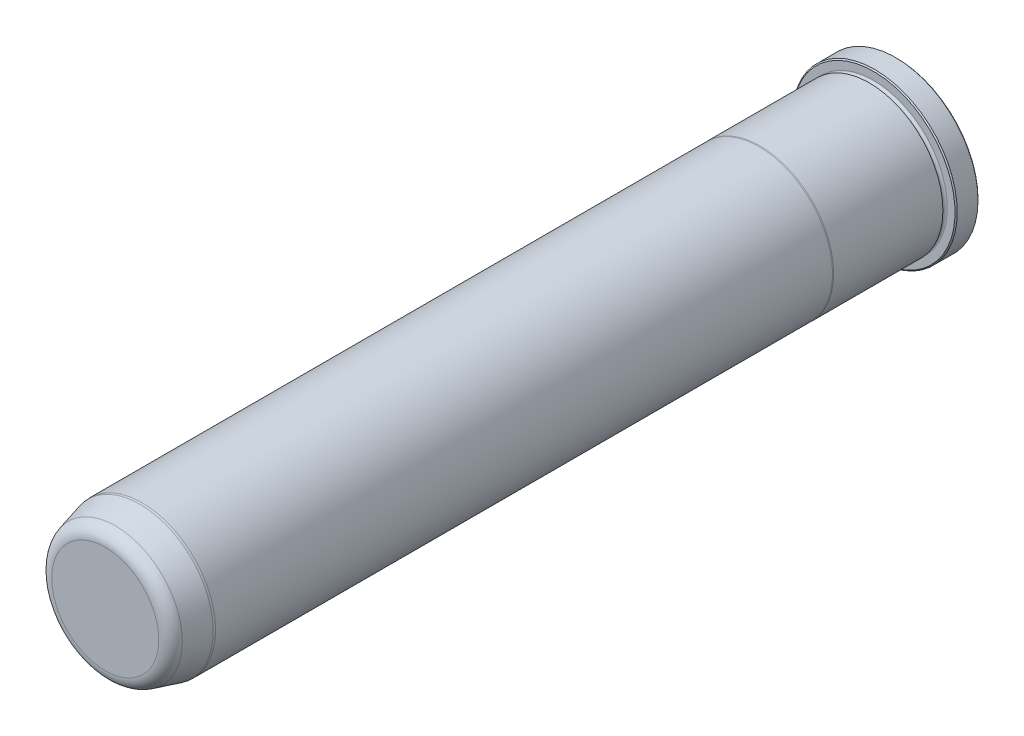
ISO-10303-21;
HEADER;
FILE_DESCRIPTION(('STEP AP214'),'2;1');
FILE_NAME('part.step','',(''),(''),'','','');
FILE_SCHEMA(('AUTOMOTIVE_DESIGN { 1 0 10303 214 1 1 1 1 }'));
ENDSEC;
DATA;
#1=APPLICATION_CONTEXT('core data for automotive mechanical design processes');
#2=APPLICATION_PROTOCOL_DEFINITION('international standard','automotive_design',2000,#1);
#3=PRODUCT_CONTEXT('',#1,'mechanical');
#4=PRODUCT('Part','Part','',(#3));
#5=PRODUCT_RELATED_PRODUCT_CATEGORY('part','',(#4));
#6=PRODUCT_DEFINITION_FORMATION('','',#4);
#7=PRODUCT_DEFINITION_CONTEXT('part definition',#1,'design');
#8=PRODUCT_DEFINITION('design','',#6,#7);
#9=PRODUCT_DEFINITION_SHAPE('','',#8);
#10=(LENGTH_UNIT() NAMED_UNIT(*) SI_UNIT(.MILLI.,.METRE.));
#11=(NAMED_UNIT(*) PLANE_ANGLE_UNIT() SI_UNIT($,.RADIAN.));
#12=(NAMED_UNIT(*) SI_UNIT($,.STERADIAN.) SOLID_ANGLE_UNIT());
#13=UNCERTAINTY_MEASURE_WITH_UNIT(LENGTH_MEASURE(1.E-05),#10,'distance_accuracy_value','');
#14=(GEOMETRIC_REPRESENTATION_CONTEXT(3) GLOBAL_UNCERTAINTY_ASSIGNED_CONTEXT((#13)) GLOBAL_UNIT_ASSIGNED_CONTEXT((#10,
#11,#12)) REPRESENTATION_CONTEXT('',''));
#15=CARTESIAN_POINT('',(0.,0.,0.));
#16=DIRECTION('',(0.,0.,1.));
#17=DIRECTION('',(1.,0.,0.));
#18=AXIS2_PLACEMENT_3D('',#15,#16,#17);
#19=CARTESIAN_POINT('',(0.,0.,0.));
#20=DIRECTION('',(0.,0.,1.));
#21=DIRECTION('',(1.,0.,0.));
#22=AXIS2_PLACEMENT_3D('',#19,#20,#21);
#23=PLANE('',#22);
#24=CARTESIAN_POINT('',(0.,0.,0.));
#25=DIRECTION('',(0.,0.,1.));
#26=DIRECTION('',(1.,0.,0.));
#27=AXIS2_PLACEMENT_3D('',#24,#25,#26);
#28=CIRCLE('',#27,28.067);
#29=CARTESIAN_POINT('',(28.067,0.,0.));
#30=VERTEX_POINT('',#29);
#31=EDGE_CURVE('E37',#30,#30,#28,.F.);
#32=ORIENTED_EDGE('',*,*,#31,.T.);
#33=EDGE_LOOP('',(#32));
#34=FACE_BOUND('',#33,.T.);
#35=ADVANCED_FACE('F30',(#34),#23,.F.);
#36=CARTESIAN_POINT('',(0.,0.,0.));
#37=DIRECTION('',(0.,0.,1.));
#38=DIRECTION('',(1.,0.,0.));
#39=AXIS2_PLACEMENT_3D('',#36,#37,#38);
#40=CYLINDRICAL_SURFACE('',#39,28.448);
#41=CARTESIAN_POINT('',(0.,0.,0.380999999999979));
#42=DIRECTION('',(0.,0.,1.));
#43=DIRECTION('',(1.,0.,0.));
#44=AXIS2_PLACEMENT_3D('',#41,#42,#43);
#45=CIRCLE('',#44,28.448);
#46=CARTESIAN_POINT('',(28.448,0.,0.380999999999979));
#47=VERTEX_POINT('',#46);
#48=EDGE_CURVE('E41',#47,#47,#45,.T.);
#49=ORIENTED_EDGE('',*,*,#48,.T.);
#50=EDGE_LOOP('',(#49));
#51=FACE_BOUND('',#50,.T.);
#52=CARTESIAN_POINT('',(0.,0.,7.54379999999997));
#53=DIRECTION('',(0.,0.,-1.));
#54=DIRECTION('',(-1.,0.,0.));
#55=AXIS2_PLACEMENT_3D('',#52,#53,#54);
#56=CIRCLE('',#55,28.448);
#57=CARTESIAN_POINT('',(-28.448,0.,7.54379999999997));
#58=VERTEX_POINT('',#57);
#59=EDGE_CURVE('E45',#58,#58,#56,.T.);
#60=ORIENTED_EDGE('',*,*,#59,.T.);
#61=EDGE_LOOP('',(#60));
#62=FACE_BOUND('',#61,.T.);
#63=ADVANCED_FACE('F118',(#51,#62),#40,.T.);
#64=CARTESIAN_POINT('',(0.,28.448,7.9248));
#65=DIRECTION('',(0.,0.,-1.));
#66=DIRECTION('',(-1.,0.,0.));
#67=AXIS2_PLACEMENT_3D('',#64,#65,#66);
#68=PLANE('',#67);
#69=CARTESIAN_POINT('',(0.,0.,7.9248));
#70=DIRECTION('',(0.,0.,-1.));
#71=DIRECTION('',(-1.,0.,0.));
#72=AXIS2_PLACEMENT_3D('',#69,#70,#71);
#73=CIRCLE('',#72,28.067);
#74=CARTESIAN_POINT('',(-28.067,0.,7.9248));
#75=VERTEX_POINT('',#74);
#76=EDGE_CURVE('E10',#75,#75,#73,.F.);
#77=ORIENTED_EDGE('',*,*,#76,.T.);
#78=EDGE_LOOP('',(#77));
#79=FACE_BOUND('',#78,.T.);
#80=CARTESIAN_POINT('',(0.,0.,7.9248));
#81=DIRECTION('',(0.,0.,1.));
#82=DIRECTION('',(1.,0.,0.));
#83=AXIS2_PLACEMENT_3D('',#80,#81,#82);
#84=CIRCLE('',#83,25.3873);
#85=CARTESIAN_POINT('',(25.3873,0.,7.9248));
#86=VERTEX_POINT('',#85);
#87=EDGE_CURVE('E56',#86,#86,#84,.T.);
#88=ORIENTED_EDGE('',*,*,#87,.F.);
#89=EDGE_LOOP('',(#88));
#90=FACE_BOUND('',#89,.T.);
#91=ADVANCED_FACE('F113',(#79,#90),#68,.F.);
#92=CARTESIAN_POINT('',(0.,0.,8.6868));
#93=DIRECTION('',(0.,0.,1.));
#94=DIRECTION('',(1.,0.,0.));
#95=AXIS2_PLACEMENT_3D('',#92,#93,#94);
#96=TOROIDAL_SURFACE('',#95,25.3873,0.761999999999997);
#97=CARTESIAN_POINT('',(0.,0.,9.44879999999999));
#98=DIRECTION('',(0.,0.,1.));
#99=DIRECTION('',(1.,0.,0.));
#100=AXIS2_PLACEMENT_3D('',#97,#98,#99);
#101=CIRCLE('',#100,25.3873);
#102=CARTESIAN_POINT('',(25.3873,0.,9.44879999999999));
#103=VERTEX_POINT('',#102);
#104=EDGE_CURVE('E59',#103,#103,#101,.T.);
#105=ORIENTED_EDGE('',*,*,#104,.F.);
#106=EDGE_LOOP('',(#105));
#107=FACE_BOUND('',#106,.T.);
#108=ORIENTED_EDGE('',*,*,#87,.T.);
#109=EDGE_LOOP('',(#108));
#110=FACE_BOUND('',#109,.T.);
#111=ADVANCED_FACE('F107',(#107,#110),#96,.F.);
#112=CARTESIAN_POINT('',(0.,25.3873,9.44879999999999));
#113=DIRECTION('',(0.,0.,1.));
#114=DIRECTION('',(1.,0.,0.));
#115=AXIS2_PLACEMENT_3D('',#112,#113,#114);
#116=PLANE('',#115);
#117=CARTESIAN_POINT('',(0.,0.,9.4488));
#118=DIRECTION('',(0.,0.,1.));
#119=DIRECTION('',(1.,0.,0.));
#120=AXIS2_PLACEMENT_3D('',#117,#118,#119);
#121=CIRCLE('',#120,25.4127);
#122=CARTESIAN_POINT('',(25.4127,0.,9.4488));
#123=VERTEX_POINT('',#122);
#124=EDGE_CURVE('E62',#123,#123,#121,.T.);
#125=ORIENTED_EDGE('',*,*,#124,.F.);
#126=EDGE_LOOP('',(#125));
#127=FACE_BOUND('',#126,.T.);
#128=ORIENTED_EDGE('',*,*,#104,.T.);
#129=EDGE_LOOP('',(#128));
#130=FACE_BOUND('',#129,.T.);
#131=ADVANCED_FACE('F101',(#127,#130),#116,.F.);
#132=CARTESIAN_POINT('',(0.,0.,0.));
#133=DIRECTION('',(0.,0.,1.));
#134=DIRECTION('',(1.,0.,0.));
#135=AXIS2_PLACEMENT_3D('',#132,#133,#134);
#136=CYLINDRICAL_SURFACE('',#135,25.4127);
#137=CARTESIAN_POINT('',(0.,0.,47.1347630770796));
#138=DIRECTION('',(0.,0.,1.));
#139=DIRECTION('',(1.,0.,0.));
#140=AXIS2_PLACEMENT_3D('',#137,#138,#139);
#141=CIRCLE('',#140,25.4127);
#142=CARTESIAN_POINT('',(25.4127,0.,47.1347630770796));
#143=VERTEX_POINT('',#142);
#144=EDGE_CURVE('E65',#143,#143,#141,.T.);
#145=ORIENTED_EDGE('',*,*,#144,.F.);
#146=EDGE_LOOP('',(#145));
#147=FACE_BOUND('',#146,.T.);
#148=ORIENTED_EDGE('',*,*,#124,.T.);
#149=EDGE_LOOP('',(#148));
#150=FACE_BOUND('',#149,.T.);
#151=ADVANCED_FACE('F95',(#147,#150),#136,.T.);
#152=CARTESIAN_POINT('',(0.,0.,47.1347630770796));
#153=DIRECTION('',(0.,0.,-1.));
#154=DIRECTION('',(-1.,0.,0.));
#155=AXIS2_PLACEMENT_3D('',#152,#153,#154);
#156=CONICAL_SURFACE('',#155,25.4127,0.0698131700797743);
#157=CARTESIAN_POINT('',(0.,0.,47.498));
#158=DIRECTION('',(0.,0.,1.));
#159=DIRECTION('',(1.,0.,0.));
#160=AXIS2_PLACEMENT_3D('',#157,#158,#159);
#161=CIRCLE('',#160,25.3873);
#162=CARTESIAN_POINT('',(25.3873,0.,47.498));
#163=VERTEX_POINT('',#162);
#164=EDGE_CURVE('E68',#163,#163,#161,.T.);
#165=ORIENTED_EDGE('',*,*,#164,.F.);
#166=EDGE_LOOP('',(#165));
#167=FACE_BOUND('',#166,.T.);
#168=ORIENTED_EDGE('',*,*,#144,.T.);
#169=EDGE_LOOP('',(#168));
#170=FACE_BOUND('',#169,.T.);
#171=ADVANCED_FACE('F89',(#167,#170),#156,.T.);
#172=CARTESIAN_POINT('',(0.,0.,0.));
#173=DIRECTION('',(0.,0.,1.));
#174=DIRECTION('',(1.,0.,0.));
#175=AXIS2_PLACEMENT_3D('',#172,#173,#174);
#176=CYLINDRICAL_SURFACE('',#175,25.3873);
#177=CARTESIAN_POINT('',(0.,0.,260.35));
#178=DIRECTION('',(0.,0.,1.));
#179=DIRECTION('',(1.,0.,0.));
#180=AXIS2_PLACEMENT_3D('',#177,#178,#179);
#181=CIRCLE('',#180,25.3873);
#182=CARTESIAN_POINT('',(25.3873,0.,260.35));
#183=VERTEX_POINT('',#182);
#184=EDGE_CURVE('E71',#183,#183,#181,.T.);
#185=ORIENTED_EDGE('',*,*,#184,.F.);
#186=EDGE_LOOP('',(#185));
#187=FACE_BOUND('',#186,.T.);
#188=ORIENTED_EDGE('',*,*,#164,.T.);
#189=EDGE_LOOP('',(#188));
#190=FACE_BOUND('',#189,.T.);
#191=ADVANCED_FACE('F83',(#187,#190),#176,.T.);
#192=CARTESIAN_POINT('',(0.,0.,260.35));
#193=DIRECTION('',(0.,0.,-1.));
#194=DIRECTION('',(-1.,0.,0.));
#195=AXIS2_PLACEMENT_3D('',#192,#193,#194);
#196=CONICAL_SURFACE('',#195,25.3873,0.0872664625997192);
#197=CARTESIAN_POINT('',(0.,0.,261.112));
#198=DIRECTION('',(0.,0.,1.));
#199=DIRECTION('',(1.,0.,0.));
#200=AXIS2_PLACEMENT_3D('',#197,#198,#199);
#201=CIRCLE('',#200,25.3206336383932);
#202=CARTESIAN_POINT('',(25.3206336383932,0.,261.112));
#203=VERTEX_POINT('',#202);
#204=EDGE_CURVE('E74',#203,#203,#201,.T.);
#205=ORIENTED_EDGE('',*,*,#204,.F.);
#206=EDGE_LOOP('',(#205));
#207=FACE_BOUND('',#206,.T.);
#208=ORIENTED_EDGE('',*,*,#184,.T.);
#209=EDGE_LOOP('',(#208));
#210=FACE_BOUND('',#209,.T.);
#211=ADVANCED_FACE('F80',(#207,#210),#196,.T.);
#212=CARTESIAN_POINT('',(0.,0.,261.112));
#213=DIRECTION('',(0.,0.,-1.));
#214=DIRECTION('',(-1.,0.,0.));
#215=AXIS2_PLACEMENT_3D('',#212,#213,#214);
#216=CONICAL_SURFACE('',#215,25.3206336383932,0.261799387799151);
#217=CARTESIAN_POINT('',(0.,0.,269.520125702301));
#218=DIRECTION('',(0.,0.,1.));
#219=DIRECTION('',(1.,0.,0.));
#220=AXIS2_PLACEMENT_3D('',#217,#218,#219);
#221=CIRCLE('',#220,23.0676831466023);
#222=CARTESIAN_POINT('',(23.0676831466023,0.,269.520125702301));
#223=VERTEX_POINT('',#222);
#224=EDGE_CURVE('E50',#223,#223,#221,.F.);
#225=ORIENTED_EDGE('',*,*,#224,.T.);
#226=EDGE_LOOP('',(#225));
#227=FACE_BOUND('',#226,.T.);
#228=ORIENTED_EDGE('',*,*,#204,.T.);
#229=EDGE_LOOP('',(#228));
#230=FACE_BOUND('',#229,.T.);
#231=ADVANCED_FACE('F78',(#227,#230),#216,.T.);
#232=CARTESIAN_POINT('',(0.,22.1218561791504,273.05));
#233=DIRECTION('',(0.,0.,-1.));
#234=DIRECTION('',(-1.,0.,0.));
#235=AXIS2_PLACEMENT_3D('',#232,#233,#234);
#236=PLANE('',#235);
#237=CARTESIAN_POINT('',(0.,0.,273.05));
#238=DIRECTION('',(0.,0.,-1.));
#239=DIRECTION('',(-1.,0.,0.));
#240=AXIS2_PLACEMENT_3D('',#237,#238,#239);
#241=CIRCLE('',#240,18.4674613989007);
#242=CARTESIAN_POINT('',(-18.4674613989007,0.,273.05));
#243=VERTEX_POINT('',#242);
#244=EDGE_CURVE('E53',#243,#243,#241,.F.);
#245=ORIENTED_EDGE('',*,*,#244,.T.);
#246=EDGE_LOOP('',(#245));
#247=FACE_BOUND('',#246,.T.);
#248=ADVANCED_FACE('F133',(#247),#236,.F.);
#249=CARTESIAN_POINT('',(0.,0.,268.2875));
#250=DIRECTION('',(0.,0.,-1.));
#251=DIRECTION('',(-1.,0.,0.));
#252=AXIS2_PLACEMENT_3D('',#249,#250,#251);
#253=TOROIDAL_SURFACE('',#252,18.4674613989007,4.7625);
#254=ORIENTED_EDGE('',*,*,#224,.F.);
#255=EDGE_LOOP('',(#254));
#256=FACE_BOUND('',#255,.T.);
#257=ORIENTED_EDGE('',*,*,#244,.F.);
#258=EDGE_LOOP('',(#257));
#259=FACE_BOUND('',#258,.T.);
#260=ADVANCED_FACE('F130',(#256,#259),#253,.T.);
#261=CARTESIAN_POINT('',(0.,0.,0.380999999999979));
#262=DIRECTION('',(0.,0.,1.));
#263=DIRECTION('',(1.,0.,0.));
#264=AXIS2_PLACEMENT_3D('',#261,#262,#263);
#265=CONICAL_SURFACE('',#264,28.448,0.785398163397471);
#266=ORIENTED_EDGE('',*,*,#31,.F.);
#267=EDGE_LOOP('',(#266));
#268=FACE_BOUND('',#267,.T.);
#269=ORIENTED_EDGE('',*,*,#48,.F.);
#270=EDGE_LOOP('',(#269));
#271=FACE_BOUND('',#270,.T.);
#272=ADVANCED_FACE('F132',(#268,#271),#265,.T.);
#273=CARTESIAN_POINT('',(0.,0.,7.9248));
#274=DIRECTION('',(0.,0.,-1.));
#275=DIRECTION('',(-1.,0.,0.));
#276=AXIS2_PLACEMENT_3D('',#273,#274,#275);
#277=CONICAL_SURFACE('',#276,28.067,0.785398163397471);
#278=ORIENTED_EDGE('',*,*,#59,.F.);
#279=EDGE_LOOP('',(#278));
#280=FACE_BOUND('',#279,.T.);
#281=ORIENTED_EDGE('',*,*,#76,.F.);
#282=EDGE_LOOP('',(#281));
#283=FACE_BOUND('',#282,.T.);
#284=ADVANCED_FACE('F32',(#280,#283),#277,.T.);
#285=CLOSED_SHELL('',(#35,#63,#91,#111,#131,#151,#171,#191,#211,#231,#248,#260,#272,#284));
#286=MANIFOLD_SOLID_BREP('B2',#285);
#287=ADVANCED_BREP_SHAPE_REPRESENTATION('',(#18,#286),#14);
#288=SHAPE_DEFINITION_REPRESENTATION(#9,#287);
ENDSEC;
END-ISO-10303-21;
